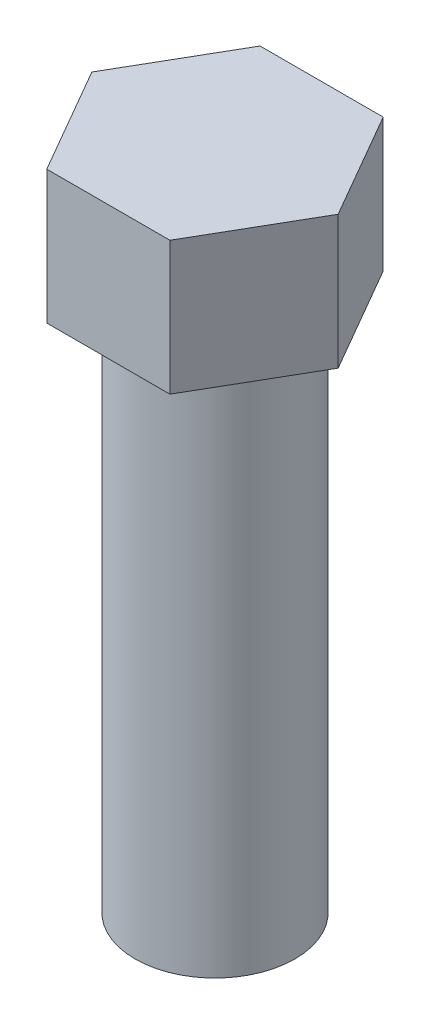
ISO-10303-21;
HEADER;
FILE_DESCRIPTION(('STEP AP214'),'2;1');
FILE_NAME('part.step','',(''),(''),'','','');
FILE_SCHEMA(('AUTOMOTIVE_DESIGN { 1 0 10303 214 1 1 1 1 }'));
ENDSEC;
DATA;
#1=APPLICATION_CONTEXT('core data for automotive mechanical design processes');
#2=APPLICATION_PROTOCOL_DEFINITION('international standard','automotive_design',2000,#1);
#3=PRODUCT_CONTEXT('',#1,'mechanical');
#4=PRODUCT('Part','Part','',(#3));
#5=PRODUCT_RELATED_PRODUCT_CATEGORY('part','',(#4));
#6=PRODUCT_DEFINITION_FORMATION('','',#4);
#7=PRODUCT_DEFINITION_CONTEXT('part definition',#1,'design');
#8=PRODUCT_DEFINITION('design','',#6,#7);
#9=PRODUCT_DEFINITION_SHAPE('','',#8);
#10=(LENGTH_UNIT() NAMED_UNIT(*) SI_UNIT(.MILLI.,.METRE.));
#11=(NAMED_UNIT(*) PLANE_ANGLE_UNIT() SI_UNIT($,.RADIAN.));
#12=(NAMED_UNIT(*) SI_UNIT($,.STERADIAN.) SOLID_ANGLE_UNIT());
#13=UNCERTAINTY_MEASURE_WITH_UNIT(LENGTH_MEASURE(1.E-05),#10,'distance_accuracy_value','');
#14=(GEOMETRIC_REPRESENTATION_CONTEXT(3) GLOBAL_UNCERTAINTY_ASSIGNED_CONTEXT((#13)) GLOBAL_UNIT_ASSIGNED_CONTEXT((#10,
#11,#12)) REPRESENTATION_CONTEXT('',''));
#15=CARTESIAN_POINT('',(0.,0.,0.));
#16=DIRECTION('',(0.,0.,1.));
#17=DIRECTION('',(1.,0.,0.));
#18=AXIS2_PLACEMENT_3D('',#15,#16,#17);
#19=CARTESIAN_POINT('',(0.,40.,0.));
#20=DIRECTION('',(0.,-1.,0.));
#21=DIRECTION('',(0.,0.,-1.));
#22=AXIS2_PLACEMENT_3D('',#19,#20,#21);
#23=CYLINDRICAL_SURFACE('',#22,6.);
#24=CARTESIAN_POINT('',(0.,40.,0.));
#25=DIRECTION('',(0.,1.,0.));
#26=DIRECTION('',(0.,0.,1.));
#27=AXIS2_PLACEMENT_3D('',#24,#25,#26);
#28=CIRCLE('',#27,6.);
#29=CARTESIAN_POINT('',(0.,40.,6.));
#30=VERTEX_POINT('',#29);
#31=EDGE_CURVE('E11',#30,#30,#28,.T.);
#32=ORIENTED_EDGE('',*,*,#31,.F.);
#33=EDGE_LOOP('',(#32));
#34=FACE_BOUND('',#33,.T.);
#35=CARTESIAN_POINT('',(0.,0.,0.));
#36=DIRECTION('',(0.,1.,0.));
#37=DIRECTION('',(0.,0.,1.));
#38=AXIS2_PLACEMENT_3D('',#35,#36,#37);
#39=CIRCLE('',#38,6.);
#40=CARTESIAN_POINT('',(0.,0.,6.));
#41=VERTEX_POINT('',#40);
#42=EDGE_CURVE('E39',#41,#41,#39,.T.);
#43=ORIENTED_EDGE('',*,*,#42,.T.);
#44=EDGE_LOOP('',(#43));
#45=FACE_BOUND('',#44,.T.);
#46=ADVANCED_FACE('F36',(#34,#45),#23,.T.);
#47=CARTESIAN_POINT('',(0.,0.,0.));
#48=DIRECTION('',(0.,1.,0.));
#49=DIRECTION('',(0.,0.,1.));
#50=AXIS2_PLACEMENT_3D('',#47,#48,#49);
#51=PLANE('',#50);
#52=ORIENTED_EDGE('',*,*,#42,.F.);
#53=EDGE_LOOP('',(#52));
#54=FACE_BOUND('',#53,.T.);
#55=ADVANCED_FACE('F144',(#54),#51,.F.);
#56=CARTESIAN_POINT('',(4.61880215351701,50.,8.00000000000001));
#57=DIRECTION('',(-0.866025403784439,0.,-0.5));
#58=DIRECTION('',(-0.5,0.,0.866025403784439));
#59=AXIS2_PLACEMENT_3D('',#56,#57,#58);
#60=PLANE('',#59);
#61=DIRECTION('',(0.499999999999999,0.,-0.866025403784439));
#62=VECTOR('',#61,1.);
#63=CARTESIAN_POINT('',(4.61880215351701,40.,8.00000000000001));
#64=LINE('',#63,#62);
#65=CARTESIAN_POINT('',(4.61880215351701,40.,8.00000000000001));
#66=VERTEX_POINT('',#65);
#67=CARTESIAN_POINT('',(9.23760430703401,40.,0.));
#68=VERTEX_POINT('',#67);
#69=EDGE_CURVE('E121',#66,#68,#64,.T.);
#70=ORIENTED_EDGE('',*,*,#69,.T.);
#71=DIRECTION('',(0.,-1.,0.));
#72=VECTOR('',#71,1.);
#73=CARTESIAN_POINT('',(9.23760430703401,50.,0.));
#74=LINE('',#73,#72);
#75=CARTESIAN_POINT('',(9.23760430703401,50.,0.));
#76=VERTEX_POINT('',#75);
#77=EDGE_CURVE('E138',#76,#68,#74,.T.);
#78=ORIENTED_EDGE('',*,*,#77,.F.);
#79=DIRECTION('',(0.499999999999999,0.,-0.866025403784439));
#80=VECTOR('',#79,1.);
#81=CARTESIAN_POINT('',(4.61880215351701,50.,8.00000000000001));
#82=LINE('',#81,#80);
#83=CARTESIAN_POINT('',(4.61880215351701,50.,8.00000000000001));
#84=VERTEX_POINT('',#83);
#85=EDGE_CURVE('E131',#84,#76,#82,.T.);
#86=ORIENTED_EDGE('',*,*,#85,.F.);
#87=DIRECTION('',(0.,-1.,0.));
#88=VECTOR('',#87,1.);
#89=CARTESIAN_POINT('',(4.61880215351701,50.,8.00000000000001));
#90=LINE('',#89,#88);
#91=EDGE_CURVE('E117',#84,#66,#90,.T.);
#92=ORIENTED_EDGE('',*,*,#91,.T.);
#93=EDGE_LOOP('',(#70,#78,#86,#92));
#94=FACE_BOUND('',#93,.T.);
#95=ADVANCED_FACE('F146',(#94),#60,.F.);
#96=CARTESIAN_POINT('',(9.23760430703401,50.,0.));
#97=DIRECTION('',(-0.866025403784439,0.,0.5));
#98=DIRECTION('',(0.5,0.,0.866025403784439));
#99=AXIS2_PLACEMENT_3D('',#96,#97,#98);
#100=PLANE('',#99);
#101=DIRECTION('',(-0.5,0.,-0.866025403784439));
#102=VECTOR('',#101,1.);
#103=CARTESIAN_POINT('',(9.23760430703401,40.,0.));
#104=LINE('',#103,#102);
#105=CARTESIAN_POINT('',(4.618802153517,40.,-8.00000000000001));
#106=VERTEX_POINT('',#105);
#107=EDGE_CURVE('E124',#68,#106,#104,.T.);
#108=ORIENTED_EDGE('',*,*,#107,.T.);
#109=DIRECTION('',(0.,-1.,0.));
#110=VECTOR('',#109,1.);
#111=CARTESIAN_POINT('',(4.618802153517,50.,-8.00000000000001));
#112=LINE('',#111,#110);
#113=CARTESIAN_POINT('',(4.618802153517,50.,-8.00000000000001));
#114=VERTEX_POINT('',#113);
#115=EDGE_CURVE('E135',#114,#106,#112,.T.);
#116=ORIENTED_EDGE('',*,*,#115,.F.);
#117=DIRECTION('',(-0.5,0.,-0.866025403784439));
#118=VECTOR('',#117,1.);
#119=CARTESIAN_POINT('',(9.23760430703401,50.,0.));
#120=LINE('',#119,#118);
#121=EDGE_CURVE('E90',#76,#114,#120,.T.);
#122=ORIENTED_EDGE('',*,*,#121,.F.);
#123=ORIENTED_EDGE('',*,*,#77,.T.);
#124=EDGE_LOOP('',(#108,#116,#122,#123));
#125=FACE_BOUND('',#124,.T.);
#126=ADVANCED_FACE('F151',(#125),#100,.F.);
#127=CARTESIAN_POINT('',(4.618802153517,50.,-8.00000000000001));
#128=DIRECTION('',(0.,0.,1.));
#129=DIRECTION('',(1.,0.,0.));
#130=AXIS2_PLACEMENT_3D('',#127,#128,#129);
#131=PLANE('',#130);
#132=DIRECTION('',(-1.,0.,0.));
#133=VECTOR('',#132,1.);
#134=CARTESIAN_POINT('',(4.618802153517,40.,-8.00000000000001));
#135=LINE('',#134,#133);
#136=CARTESIAN_POINT('',(-4.61880215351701,40.,-8.00000000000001));
#137=VERTEX_POINT('',#136);
#138=EDGE_CURVE('E126',#106,#137,#135,.T.);
#139=ORIENTED_EDGE('',*,*,#138,.T.);
#140=DIRECTION('',(0.,-1.,0.));
#141=VECTOR('',#140,1.);
#142=CARTESIAN_POINT('',(-4.61880215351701,50.,-8.00000000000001));
#143=LINE('',#142,#141);
#144=CARTESIAN_POINT('',(-4.61880215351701,50.,-8.00000000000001));
#145=VERTEX_POINT('',#144);
#146=EDGE_CURVE('E112',#145,#137,#143,.T.);
#147=ORIENTED_EDGE('',*,*,#146,.F.);
#148=DIRECTION('',(-1.,0.,0.));
#149=VECTOR('',#148,1.);
#150=CARTESIAN_POINT('',(4.618802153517,50.,-8.00000000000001));
#151=LINE('',#150,#149);
#152=EDGE_CURVE('E103',#114,#145,#151,.T.);
#153=ORIENTED_EDGE('',*,*,#152,.F.);
#154=ORIENTED_EDGE('',*,*,#115,.T.);
#155=EDGE_LOOP('',(#139,#147,#153,#154));
#156=FACE_BOUND('',#155,.T.);
#157=ADVANCED_FACE('F158',(#156),#131,.F.);
#158=CARTESIAN_POINT('',(-4.61880215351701,50.,-8.00000000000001));
#159=DIRECTION('',(0.866025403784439,0.,0.5));
#160=DIRECTION('',(0.5,0.,-0.866025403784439));
#161=AXIS2_PLACEMENT_3D('',#158,#159,#160);
#162=PLANE('',#161);
#163=DIRECTION('',(-0.5,0.,0.866025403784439));
#164=VECTOR('',#163,1.);
#165=CARTESIAN_POINT('',(-4.61880215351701,40.,-8.00000000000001));
#166=LINE('',#165,#164);
#167=CARTESIAN_POINT('',(-9.23760430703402,40.,0.));
#168=VERTEX_POINT('',#167);
#169=EDGE_CURVE('E111',#137,#168,#166,.T.);
#170=ORIENTED_EDGE('',*,*,#169,.T.);
#171=DIRECTION('',(0.,-1.,0.));
#172=VECTOR('',#171,1.);
#173=CARTESIAN_POINT('',(-9.23760430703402,50.,0.));
#174=LINE('',#173,#172);
#175=CARTESIAN_POINT('',(-9.23760430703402,50.,0.));
#176=VERTEX_POINT('',#175);
#177=EDGE_CURVE('E108',#176,#168,#174,.T.);
#178=ORIENTED_EDGE('',*,*,#177,.F.);
#179=DIRECTION('',(-0.5,0.,0.866025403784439));
#180=VECTOR('',#179,1.);
#181=CARTESIAN_POINT('',(-4.61880215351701,50.,-8.00000000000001));
#182=LINE('',#181,#180);
#183=EDGE_CURVE('E97',#145,#176,#182,.T.);
#184=ORIENTED_EDGE('',*,*,#183,.F.);
#185=ORIENTED_EDGE('',*,*,#146,.T.);
#186=EDGE_LOOP('',(#170,#178,#184,#185));
#187=FACE_BOUND('',#186,.T.);
#188=ADVANCED_FACE('F109',(#187),#162,.F.);
#189=CARTESIAN_POINT('',(-9.23760430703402,50.,0.));
#190=DIRECTION('',(0.866025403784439,0.,-0.5));
#191=DIRECTION('',(-0.5,0.,-0.866025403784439));
#192=AXIS2_PLACEMENT_3D('',#189,#190,#191);
#193=PLANE('',#192);
#194=DIRECTION('',(0.5,0.,0.866025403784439));
#195=VECTOR('',#194,1.);
#196=CARTESIAN_POINT('',(-9.23760430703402,40.,0.));
#197=LINE('',#196,#195);
#198=CARTESIAN_POINT('',(-4.61880215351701,40.,8.));
#199=VERTEX_POINT('',#198);
#200=EDGE_CURVE('E75',#168,#199,#197,.T.);
#201=ORIENTED_EDGE('',*,*,#200,.T.);
#202=DIRECTION('',(0.,-1.,0.));
#203=VECTOR('',#202,1.);
#204=CARTESIAN_POINT('',(-4.61880215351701,50.,8.));
#205=LINE('',#204,#203);
#206=CARTESIAN_POINT('',(-4.61880215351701,50.,8.));
#207=VERTEX_POINT('',#206);
#208=EDGE_CURVE('E113',#207,#199,#205,.T.);
#209=ORIENTED_EDGE('',*,*,#208,.F.);
#210=DIRECTION('',(0.5,0.,0.866025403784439));
#211=VECTOR('',#210,1.);
#212=CARTESIAN_POINT('',(-9.23760430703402,50.,0.));
#213=LINE('',#212,#211);
#214=EDGE_CURVE('E101',#176,#207,#213,.T.);
#215=ORIENTED_EDGE('',*,*,#214,.F.);
#216=ORIENTED_EDGE('',*,*,#177,.T.);
#217=EDGE_LOOP('',(#201,#209,#215,#216));
#218=FACE_BOUND('',#217,.T.);
#219=ADVANCED_FACE('F115',(#218),#193,.F.);
#220=CARTESIAN_POINT('',(-4.61880215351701,50.,8.));
#221=DIRECTION('',(0.,0.,-1.));
#222=DIRECTION('',(-1.,0.,0.));
#223=AXIS2_PLACEMENT_3D('',#220,#221,#222);
#224=PLANE('',#223);
#225=DIRECTION('',(1.,0.,0.));
#226=VECTOR('',#225,1.);
#227=CARTESIAN_POINT('',(-4.61880215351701,40.,8.));
#228=LINE('',#227,#226);
#229=EDGE_CURVE('E81',#199,#66,#228,.T.);
#230=ORIENTED_EDGE('',*,*,#229,.T.);
#231=ORIENTED_EDGE('',*,*,#91,.F.);
#232=DIRECTION('',(1.,0.,0.));
#233=VECTOR('',#232,1.);
#234=CARTESIAN_POINT('',(-4.61880215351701,50.,8.));
#235=LINE('',#234,#233);
#236=EDGE_CURVE('E52',#207,#84,#235,.T.);
#237=ORIENTED_EDGE('',*,*,#236,.F.);
#238=ORIENTED_EDGE('',*,*,#208,.T.);
#239=EDGE_LOOP('',(#230,#231,#237,#238));
#240=FACE_BOUND('',#239,.T.);
#241=ADVANCED_FACE('F166',(#240),#224,.F.);
#242=CARTESIAN_POINT('',(0.,50.,0.));
#243=DIRECTION('',(0.,1.,0.));
#244=DIRECTION('',(0.,0.,1.));
#245=AXIS2_PLACEMENT_3D('',#242,#243,#244);
#246=PLANE('',#245);
#247=ORIENTED_EDGE('',*,*,#85,.T.);
#248=ORIENTED_EDGE('',*,*,#121,.T.);
#249=ORIENTED_EDGE('',*,*,#152,.T.);
#250=ORIENTED_EDGE('',*,*,#183,.T.);
#251=ORIENTED_EDGE('',*,*,#214,.T.);
#252=ORIENTED_EDGE('',*,*,#236,.T.);
#253=EDGE_LOOP('',(#247,#248,#249,#250,#251,#252));
#254=FACE_BOUND('',#253,.T.);
#255=ADVANCED_FACE('F99',(#254),#246,.T.);
#256=CARTESIAN_POINT('',(0.,40.,0.));
#257=DIRECTION('',(0.,1.,0.));
#258=DIRECTION('',(0.,0.,1.));
#259=AXIS2_PLACEMENT_3D('',#256,#257,#258);
#260=PLANE('',#259);
#261=ORIENTED_EDGE('',*,*,#31,.T.);
#262=EDGE_LOOP('',(#261));
#263=FACE_BOUND('',#262,.T.);
#264=ORIENTED_EDGE('',*,*,#69,.F.);
#265=ORIENTED_EDGE('',*,*,#229,.F.);
#266=ORIENTED_EDGE('',*,*,#200,.F.);
#267=ORIENTED_EDGE('',*,*,#169,.F.);
#268=ORIENTED_EDGE('',*,*,#138,.F.);
#269=ORIENTED_EDGE('',*,*,#107,.F.);
#270=EDGE_LOOP('',(#264,#265,#266,#267,#268,#269));
#271=FACE_BOUND('',#270,.T.);
#272=ADVANCED_FACE('F169',(#263,#271),#260,.F.);
#273=CLOSED_SHELL('',(#46,#55,#95,#126,#157,#188,#219,#241,#255,#272));
#274=MANIFOLD_SOLID_BREP('B2',#273);
#275=ADVANCED_BREP_SHAPE_REPRESENTATION('',(#18,#274),#14);
#276=SHAPE_DEFINITION_REPRESENTATION(#9,#275);
ENDSEC;
END-ISO-10303-21;
